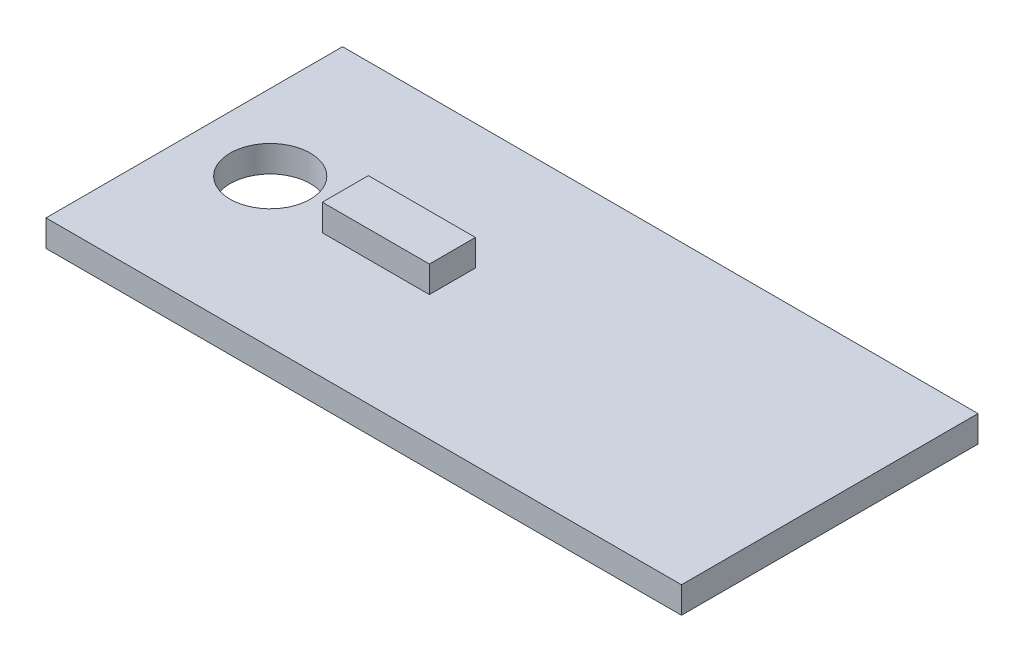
ISO-10303-21;
HEADER;
FILE_DESCRIPTION(('STEP AP214'),'2;1');
FILE_NAME('part.step','',(''),(''),'','','');
FILE_SCHEMA(('AUTOMOTIVE_DESIGN { 1 0 10303 214 1 1 1 1 }'));
ENDSEC;
DATA;
#1=APPLICATION_CONTEXT('core data for automotive mechanical design processes');
#2=APPLICATION_PROTOCOL_DEFINITION('international standard','automotive_design',2000,#1);
#3=PRODUCT_CONTEXT('',#1,'mechanical');
#4=PRODUCT('Part','Part','',(#3));
#5=PRODUCT_RELATED_PRODUCT_CATEGORY('part','',(#4));
#6=PRODUCT_DEFINITION_FORMATION('','',#4);
#7=PRODUCT_DEFINITION_CONTEXT('part definition',#1,'design');
#8=PRODUCT_DEFINITION('design','',#6,#7);
#9=PRODUCT_DEFINITION_SHAPE('','',#8);
#10=(LENGTH_UNIT() NAMED_UNIT(*) SI_UNIT(.MILLI.,.METRE.));
#11=(NAMED_UNIT(*) PLANE_ANGLE_UNIT() SI_UNIT($,.RADIAN.));
#12=(NAMED_UNIT(*) SI_UNIT($,.STERADIAN.) SOLID_ANGLE_UNIT());
#13=UNCERTAINTY_MEASURE_WITH_UNIT(LENGTH_MEASURE(1.E-05),#10,'distance_accuracy_value','');
#14=(GEOMETRIC_REPRESENTATION_CONTEXT(3) GLOBAL_UNCERTAINTY_ASSIGNED_CONTEXT((#13)) GLOBAL_UNIT_ASSIGNED_CONTEXT((#10,
#11,#12)) REPRESENTATION_CONTEXT('',''));
#15=CARTESIAN_POINT('',(0.,0.,0.));
#16=DIRECTION('',(0.,0.,1.));
#17=DIRECTION('',(1.,0.,0.));
#18=AXIS2_PLACEMENT_3D('',#15,#16,#17);
#19=CARTESIAN_POINT('',(0.,0.79375,0.));
#20=DIRECTION('',(0.,1.,0.));
#21=DIRECTION('',(0.,0.,1.));
#22=AXIS2_PLACEMENT_3D('',#19,#20,#21);
#23=PLANE('',#22);
#24=CARTESIAN_POINT('',(2.27698821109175,0.79375,0.));
#25=DIRECTION('',(0.,1.,0.));
#26=DIRECTION('',(0.,0.,1.));
#27=AXIS2_PLACEMENT_3D('',#24,#25,#26);
#28=CIRCLE('',#27,1.2);
#29=CARTESIAN_POINT('',(2.27698821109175,0.79375,1.2));
#30=VERTEX_POINT('',#29);
#31=EDGE_CURVE('E242',#30,#30,#28,.T.);
#32=ORIENTED_EDGE('',*,*,#31,.F.);
#33=EDGE_LOOP('',(#32));
#34=FACE_BOUND('',#33,.T.);
#35=DIRECTION('',(0.,0.,1.));
#36=VECTOR('',#35,1.);
#37=CARTESIAN_POINT('',(0.,0.79375,-4.445));
#38=LINE('',#37,#36);
#39=CARTESIAN_POINT('',(0.,0.79375,-4.445));
#40=VERTEX_POINT('',#39);
#41=CARTESIAN_POINT('',(0.,0.79375,4.445));
#42=VERTEX_POINT('',#41);
#43=EDGE_CURVE('E164',#40,#42,#38,.T.);
#44=ORIENTED_EDGE('',*,*,#43,.T.);
#45=DIRECTION('',(1.,0.,0.));
#46=VECTOR('',#45,1.);
#47=CARTESIAN_POINT('',(0.,0.79375,4.445));
#48=LINE('',#47,#46);
#49=CARTESIAN_POINT('',(19.05,0.79375,4.44499999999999));
#50=VERTEX_POINT('',#49);
#51=EDGE_CURVE('E104',#42,#50,#48,.T.);
#52=ORIENTED_EDGE('',*,*,#51,.T.);
#53=DIRECTION('',(0.,0.,-1.));
#54=VECTOR('',#53,1.);
#55=CARTESIAN_POINT('',(19.05,0.79375,-4.445));
#56=LINE('',#55,#54);
#57=CARTESIAN_POINT('',(19.05,0.79375,-4.445));
#58=VERTEX_POINT('',#57);
#59=EDGE_CURVE('E169',#50,#58,#56,.T.);
#60=ORIENTED_EDGE('',*,*,#59,.T.);
#61=DIRECTION('',(-1.,0.,0.));
#62=VECTOR('',#61,1.);
#63=CARTESIAN_POINT('',(0.,0.79375,-4.445));
#64=LINE('',#63,#62);
#65=EDGE_CURVE('E76',#58,#40,#64,.T.);
#66=ORIENTED_EDGE('',*,*,#65,.T.);
#67=EDGE_LOOP('',(#44,#52,#60,#66));
#68=FACE_BOUND('',#67,.T.);
#69=DIRECTION('',(1.,0.,0.));
#70=VECTOR('',#69,1.);
#71=CARTESIAN_POINT('',(4.52837463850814,0.79375,0.689941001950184));
#72=LINE('',#71,#70);
#73=CARTESIAN_POINT('',(4.52837463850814,0.79375,0.689941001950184));
#74=VERTEX_POINT('',#73);
#75=CARTESIAN_POINT('',(7.73841593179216,0.79375,0.689941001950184));
#76=VERTEX_POINT('',#75);
#77=EDGE_CURVE('E255',#74,#76,#72,.T.);
#78=ORIENTED_EDGE('',*,*,#77,.F.);
#79=DIRECTION('',(0.,0.,1.));
#80=VECTOR('',#79,1.);
#81=CARTESIAN_POINT('',(4.52837463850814,0.79375,-0.689941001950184));
#82=LINE('',#81,#80);
#83=CARTESIAN_POINT('',(4.52837463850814,0.79375,-0.689941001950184));
#84=VERTEX_POINT('',#83);
#85=EDGE_CURVE('E151',#84,#74,#82,.T.);
#86=ORIENTED_EDGE('',*,*,#85,.F.);
#87=DIRECTION('',(-1.,0.,0.));
#88=VECTOR('',#87,1.);
#89=CARTESIAN_POINT('',(4.52837463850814,0.79375,-0.689941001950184));
#90=LINE('',#89,#88);
#91=CARTESIAN_POINT('',(7.73841593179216,0.79375,-0.689941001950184));
#92=VERTEX_POINT('',#91);
#93=EDGE_CURVE('E147',#92,#84,#90,.T.);
#94=ORIENTED_EDGE('',*,*,#93,.F.);
#95=DIRECTION('',(0.,0.,-1.));
#96=VECTOR('',#95,1.);
#97=CARTESIAN_POINT('',(7.73841593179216,0.79375,-0.689941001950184));
#98=LINE('',#97,#96);
#99=EDGE_CURVE('E258',#76,#92,#98,.T.);
#100=ORIENTED_EDGE('',*,*,#99,.F.);
#101=EDGE_LOOP('',(#78,#86,#94,#100));
#102=FACE_BOUND('',#101,.T.);
#103=ADVANCED_FACE('F51',(#34,#68,#102),#23,.T.);
#104=CARTESIAN_POINT('',(0.,0.79375,-4.445));
#105=DIRECTION('',(1.,0.,0.));
#106=DIRECTION('',(0.,0.,-1.));
#107=AXIS2_PLACEMENT_3D('',#104,#105,#106);
#108=PLANE('',#107);
#109=DIRECTION('',(0.,0.,1.));
#110=VECTOR('',#109,1.);
#111=CARTESIAN_POINT('',(0.,0.,-4.445));
#112=LINE('',#111,#110);
#113=CARTESIAN_POINT('',(0.,0.,-4.445));
#114=VERTEX_POINT('',#113);
#115=CARTESIAN_POINT('',(0.,0.,4.445));
#116=VERTEX_POINT('',#115);
#117=EDGE_CURVE('E154',#114,#116,#112,.T.);
#118=ORIENTED_EDGE('',*,*,#117,.T.);
#119=DIRECTION('',(0.,-1.,0.));
#120=VECTOR('',#119,1.);
#121=CARTESIAN_POINT('',(0.,0.79375,4.445));
#122=LINE('',#121,#120);
#123=EDGE_CURVE('E11',#42,#116,#122,.T.);
#124=ORIENTED_EDGE('',*,*,#123,.F.);
#125=ORIENTED_EDGE('',*,*,#43,.F.);
#126=DIRECTION('',(0.,-1.,0.));
#127=VECTOR('',#126,1.);
#128=CARTESIAN_POINT('',(0.,0.79375,-4.445));
#129=LINE('',#128,#127);
#130=EDGE_CURVE('E173',#40,#114,#129,.T.);
#131=ORIENTED_EDGE('',*,*,#130,.T.);
#132=EDGE_LOOP('',(#118,#124,#125,#131));
#133=FACE_BOUND('',#132,.T.);
#134=ADVANCED_FACE('F53',(#133),#108,.F.);
#135=CARTESIAN_POINT('',(0.,0.79375,4.445));
#136=DIRECTION('',(0.,0.,-1.));
#137=DIRECTION('',(-1.,0.,0.));
#138=AXIS2_PLACEMENT_3D('',#135,#136,#137);
#139=PLANE('',#138);
#140=DIRECTION('',(1.,0.,0.));
#141=VECTOR('',#140,1.);
#142=CARTESIAN_POINT('',(0.,0.,4.445));
#143=LINE('',#142,#141);
#144=CARTESIAN_POINT('',(19.05,0.,4.44499999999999));
#145=VERTEX_POINT('',#144);
#146=EDGE_CURVE('E159',#116,#145,#143,.T.);
#147=ORIENTED_EDGE('',*,*,#146,.T.);
#148=DIRECTION('',(0.,-1.,0.));
#149=VECTOR('',#148,1.);
#150=CARTESIAN_POINT('',(19.05,0.79375,4.44499999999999));
#151=LINE('',#150,#149);
#152=EDGE_CURVE('E60',#50,#145,#151,.T.);
#153=ORIENTED_EDGE('',*,*,#152,.F.);
#154=ORIENTED_EDGE('',*,*,#51,.F.);
#155=ORIENTED_EDGE('',*,*,#123,.T.);
#156=EDGE_LOOP('',(#147,#153,#154,#155));
#157=FACE_BOUND('',#156,.T.);
#158=ADVANCED_FACE('F208',(#157),#139,.F.);
#159=CARTESIAN_POINT('',(19.05,0.79375,-4.445));
#160=DIRECTION('',(-1.,0.,0.));
#161=DIRECTION('',(0.,0.,1.));
#162=AXIS2_PLACEMENT_3D('',#159,#160,#161);
#163=PLANE('',#162);
#164=DIRECTION('',(0.,0.,-1.));
#165=VECTOR('',#164,1.);
#166=CARTESIAN_POINT('',(19.05,0.,-4.445));
#167=LINE('',#166,#165);
#168=CARTESIAN_POINT('',(19.05,0.,-4.445));
#169=VERTEX_POINT('',#168);
#170=EDGE_CURVE('E177',#145,#169,#167,.T.);
#171=ORIENTED_EDGE('',*,*,#170,.T.);
#172=DIRECTION('',(0.,-1.,0.));
#173=VECTOR('',#172,1.);
#174=CARTESIAN_POINT('',(19.05,0.79375,-4.445));
#175=LINE('',#174,#173);
#176=EDGE_CURVE('E184',#58,#169,#175,.T.);
#177=ORIENTED_EDGE('',*,*,#176,.F.);
#178=ORIENTED_EDGE('',*,*,#59,.F.);
#179=ORIENTED_EDGE('',*,*,#152,.T.);
#180=EDGE_LOOP('',(#171,#177,#178,#179));
#181=FACE_BOUND('',#180,.T.);
#182=ADVANCED_FACE('F191',(#181),#163,.F.);
#183=CARTESIAN_POINT('',(0.,0.79375,-4.445));
#184=DIRECTION('',(0.,0.,1.));
#185=DIRECTION('',(1.,0.,0.));
#186=AXIS2_PLACEMENT_3D('',#183,#184,#185);
#187=PLANE('',#186);
#188=DIRECTION('',(-1.,0.,0.));
#189=VECTOR('',#188,1.);
#190=CARTESIAN_POINT('',(0.,0.,-4.445));
#191=LINE('',#190,#189);
#192=EDGE_CURVE('E97',#169,#114,#191,.T.);
#193=ORIENTED_EDGE('',*,*,#192,.T.);
#194=ORIENTED_EDGE('',*,*,#130,.F.);
#195=ORIENTED_EDGE('',*,*,#65,.F.);
#196=ORIENTED_EDGE('',*,*,#176,.T.);
#197=EDGE_LOOP('',(#193,#194,#195,#196));
#198=FACE_BOUND('',#197,.T.);
#199=ADVANCED_FACE('F199',(#198),#187,.F.);
#200=CARTESIAN_POINT('',(0.,0.,0.));
#201=DIRECTION('',(0.,1.,0.));
#202=DIRECTION('',(0.,0.,1.));
#203=AXIS2_PLACEMENT_3D('',#200,#201,#202);
#204=PLANE('',#203);
#205=CARTESIAN_POINT('',(2.27698821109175,0.,0.));
#206=DIRECTION('',(0.,1.,0.));
#207=DIRECTION('',(0.,0.,1.));
#208=AXIS2_PLACEMENT_3D('',#205,#206,#207);
#209=CIRCLE('',#208,1.2);
#210=CARTESIAN_POINT('',(2.27698821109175,0.,1.2));
#211=VERTEX_POINT('',#210);
#212=EDGE_CURVE('E240',#211,#211,#209,.T.);
#213=ORIENTED_EDGE('',*,*,#212,.T.);
#214=EDGE_LOOP('',(#213));
#215=FACE_BOUND('',#214,.T.);
#216=ORIENTED_EDGE('',*,*,#117,.F.);
#217=ORIENTED_EDGE('',*,*,#192,.F.);
#218=ORIENTED_EDGE('',*,*,#170,.F.);
#219=ORIENTED_EDGE('',*,*,#146,.F.);
#220=EDGE_LOOP('',(#216,#217,#218,#219));
#221=FACE_BOUND('',#220,.T.);
#222=ADVANCED_FACE('F195',(#215,#221),#204,.F.);
#223=CARTESIAN_POINT('',(4.52837463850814,1.5875,-0.689941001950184));
#224=DIRECTION('',(1.,0.,0.));
#225=DIRECTION('',(0.,0.,-1.));
#226=AXIS2_PLACEMENT_3D('',#223,#224,#225);
#227=PLANE('',#226);
#228=ORIENTED_EDGE('',*,*,#85,.T.);
#229=DIRECTION('',(0.,-1.,0.));
#230=VECTOR('',#229,1.);
#231=CARTESIAN_POINT('',(4.52837463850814,1.5875,0.689941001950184));
#232=LINE('',#231,#230);
#233=CARTESIAN_POINT('',(4.52837463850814,1.5875,0.689941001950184));
#234=VERTEX_POINT('',#233);
#235=EDGE_CURVE('E130',#234,#74,#232,.T.);
#236=ORIENTED_EDGE('',*,*,#235,.F.);
#237=DIRECTION('',(0.,0.,1.));
#238=VECTOR('',#237,1.);
#239=CARTESIAN_POINT('',(4.52837463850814,1.5875,-0.689941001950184));
#240=LINE('',#239,#238);
#241=CARTESIAN_POINT('',(4.52837463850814,1.5875,-0.689941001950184));
#242=VERTEX_POINT('',#241);
#243=EDGE_CURVE('E138',#242,#234,#240,.T.);
#244=ORIENTED_EDGE('',*,*,#243,.F.);
#245=DIRECTION('',(0.,-1.,0.));
#246=VECTOR('',#245,1.);
#247=CARTESIAN_POINT('',(4.52837463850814,1.5875,-0.689941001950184));
#248=LINE('',#247,#246);
#249=EDGE_CURVE('E252',#242,#84,#248,.T.);
#250=ORIENTED_EDGE('',*,*,#249,.T.);
#251=EDGE_LOOP('',(#228,#236,#244,#250));
#252=FACE_BOUND('',#251,.T.);
#253=ADVANCED_FACE('F149',(#252),#227,.F.);
#254=CARTESIAN_POINT('',(4.52837463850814,1.5875,0.689941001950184));
#255=DIRECTION('',(0.,0.,-1.));
#256=DIRECTION('',(-1.,0.,0.));
#257=AXIS2_PLACEMENT_3D('',#254,#255,#256);
#258=PLANE('',#257);
#259=ORIENTED_EDGE('',*,*,#77,.T.);
#260=DIRECTION('',(0.,-1.,0.));
#261=VECTOR('',#260,1.);
#262=CARTESIAN_POINT('',(7.73841593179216,1.5875,0.689941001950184));
#263=LINE('',#262,#261);
#264=CARTESIAN_POINT('',(7.73841593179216,1.5875,0.689941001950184));
#265=VERTEX_POINT('',#264);
#266=EDGE_CURVE('E133',#265,#76,#263,.T.);
#267=ORIENTED_EDGE('',*,*,#266,.F.);
#268=DIRECTION('',(1.,0.,0.));
#269=VECTOR('',#268,1.);
#270=CARTESIAN_POINT('',(4.52837463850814,1.5875,0.689941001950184));
#271=LINE('',#270,#269);
#272=EDGE_CURVE('E126',#234,#265,#271,.T.);
#273=ORIENTED_EDGE('',*,*,#272,.F.);
#274=ORIENTED_EDGE('',*,*,#235,.T.);
#275=EDGE_LOOP('',(#259,#267,#273,#274));
#276=FACE_BOUND('',#275,.T.);
#277=ADVANCED_FACE('F128',(#276),#258,.F.);
#278=CARTESIAN_POINT('',(7.73841593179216,1.5875,-0.689941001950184));
#279=DIRECTION('',(-1.,0.,0.));
#280=DIRECTION('',(0.,0.,1.));
#281=AXIS2_PLACEMENT_3D('',#278,#279,#280);
#282=PLANE('',#281);
#283=ORIENTED_EDGE('',*,*,#99,.T.);
#284=DIRECTION('',(0.,-1.,0.));
#285=VECTOR('',#284,1.);
#286=CARTESIAN_POINT('',(7.73841593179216,1.5875,-0.689941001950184));
#287=LINE('',#286,#285);
#288=CARTESIAN_POINT('',(7.73841593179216,1.5875,-0.689941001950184));
#289=VERTEX_POINT('',#288);
#290=EDGE_CURVE('E67',#289,#92,#287,.T.);
#291=ORIENTED_EDGE('',*,*,#290,.F.);
#292=DIRECTION('',(0.,0.,-1.));
#293=VECTOR('',#292,1.);
#294=CARTESIAN_POINT('',(7.73841593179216,1.5875,-0.689941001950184));
#295=LINE('',#294,#293);
#296=EDGE_CURVE('E137',#265,#289,#295,.T.);
#297=ORIENTED_EDGE('',*,*,#296,.F.);
#298=ORIENTED_EDGE('',*,*,#266,.T.);
#299=EDGE_LOOP('',(#283,#291,#297,#298));
#300=FACE_BOUND('',#299,.T.);
#301=ADVANCED_FACE('F222',(#300),#282,.F.);
#302=CARTESIAN_POINT('',(4.52837463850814,1.5875,-0.689941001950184));
#303=DIRECTION('',(0.,0.,1.));
#304=DIRECTION('',(1.,0.,0.));
#305=AXIS2_PLACEMENT_3D('',#302,#303,#304);
#306=PLANE('',#305);
#307=ORIENTED_EDGE('',*,*,#93,.T.);
#308=ORIENTED_EDGE('',*,*,#249,.F.);
#309=DIRECTION('',(-1.,0.,0.));
#310=VECTOR('',#309,1.);
#311=CARTESIAN_POINT('',(4.52837463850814,1.5875,-0.689941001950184));
#312=LINE('',#311,#310);
#313=EDGE_CURVE('E142',#289,#242,#312,.T.);
#314=ORIENTED_EDGE('',*,*,#313,.F.);
#315=ORIENTED_EDGE('',*,*,#290,.T.);
#316=EDGE_LOOP('',(#307,#308,#314,#315));
#317=FACE_BOUND('',#316,.T.);
#318=ADVANCED_FACE('F225',(#317),#306,.F.);
#319=CARTESIAN_POINT('',(0.,1.5875,0.));
#320=DIRECTION('',(0.,1.,0.));
#321=DIRECTION('',(0.,0.,1.));
#322=AXIS2_PLACEMENT_3D('',#319,#320,#321);
#323=PLANE('',#322);
#324=ORIENTED_EDGE('',*,*,#243,.T.);
#325=ORIENTED_EDGE('',*,*,#272,.T.);
#326=ORIENTED_EDGE('',*,*,#296,.T.);
#327=ORIENTED_EDGE('',*,*,#313,.T.);
#328=EDGE_LOOP('',(#324,#325,#326,#327));
#329=FACE_BOUND('',#328,.T.);
#330=ADVANCED_FACE('F141',(#329),#323,.T.);
#331=CARTESIAN_POINT('',(2.27698821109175,0.79375,0.));
#332=DIRECTION('',(0.,1.,0.));
#333=DIRECTION('',(0.,0.,1.));
#334=AXIS2_PLACEMENT_3D('',#331,#332,#333);
#335=CYLINDRICAL_SURFACE('',#334,1.2);
#336=ORIENTED_EDGE('',*,*,#212,.F.);
#337=EDGE_LOOP('',(#336));
#338=FACE_BOUND('',#337,.T.);
#339=ORIENTED_EDGE('',*,*,#31,.T.);
#340=EDGE_LOOP('',(#339));
#341=FACE_BOUND('',#340,.T.);
#342=ADVANCED_FACE('F231',(#338,#341),#335,.F.);
#343=CLOSED_SHELL('',(#103,#134,#158,#182,#199,#222,#253,#277,#301,#318,#330,#342));
#344=MANIFOLD_SOLID_BREP('B2',#343);
#345=ADVANCED_BREP_SHAPE_REPRESENTATION('',(#18,#344),#14);
#346=SHAPE_DEFINITION_REPRESENTATION(#9,#345);
ENDSEC;
END-ISO-10303-21;
